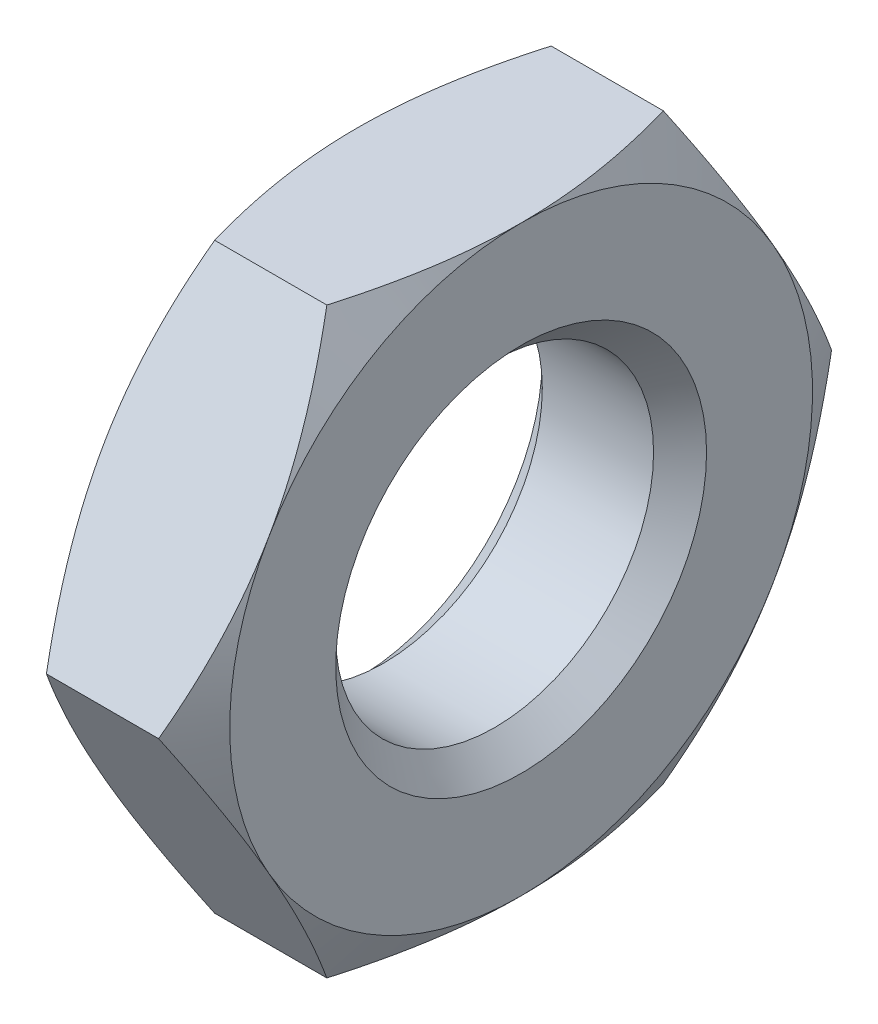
from build123d import *

# Parameters (mm, degrees)
SKETCH1_R      = 1.5
EXTRUDE1_DEPTH = 1.55
CHAMFER1_SIZE  = 0.25


with BuildPart() as part:
    # Sketch1 → Extrude1 (new body)
    with BuildSketch(Plane(origin=(0, 0, 0), x_dir=(0, 0, -1), z_dir=(1, 0, 0))):
        Polygon((1.58771324, 2.75), (-1.58771324, 2.75), (-3.175426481, 0), (-1.58771324, -2.75), (1.58771324, -2.75), (3.175426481, 0), align=None)
        with Locations(Location((0, 0, 0), (0, 0, 180))):
            Circle(SKETCH1_R, mode=Mode.SUBTRACT)
    extrude(amount=EXTRUDE1_DEPTH)

    # Sketch2 → Cut-Revolve1 (revolve, cut)
    with BuildSketch(Plane.XY):
        Polygon((1.55, 2.75), (1.55, 11), (0, 11), (0, 2.75), (0.775, 4.092339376), align=None)
    revolve(axis=Axis((1.55, 0, 0), (-1, 0, 0)), mode=Mode.SUBTRACT)

    # Chamfer1
    chamfer1_edges = [part.edges().sort_by_distance(p)[0] for p in [
        (0, 0, -1.5),
        (1.55, 0, -1.5),
    ]]
    chamfer(chamfer1_edges, length=CHAMFER1_SIZE)


solid = part.part
